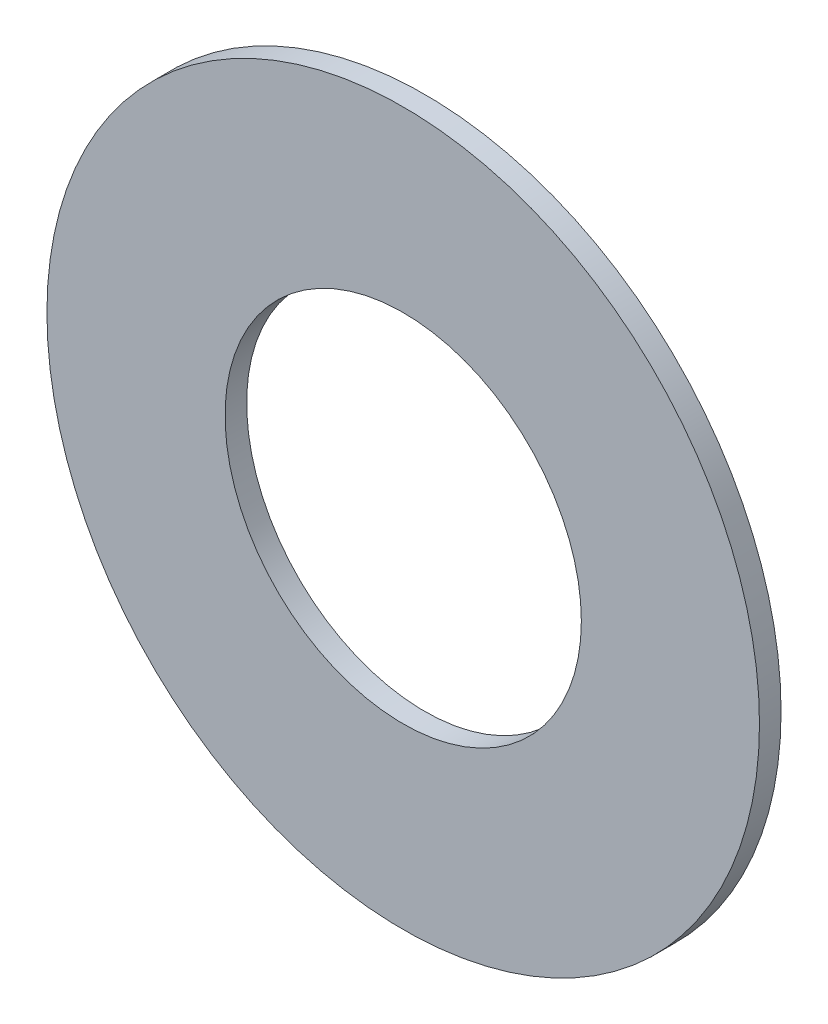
from build123d import *

# Parameters (mm, degrees)
ESQUISSE1_R          = 33
ESQUISSE1_R_2        = 16.5
BASE_EXTRUSION_DEPTH = 2


with BuildPart() as part:
    # Esquisse1 → Base-Extrusion (new body)
    with BuildSketch(Plane.XY):
        Circle(ESQUISSE1_R)
        Circle(ESQUISSE1_R_2, mode=Mode.SUBTRACT)
    extrude(amount=BASE_EXTRUSION_DEPTH)


solid = part.part
